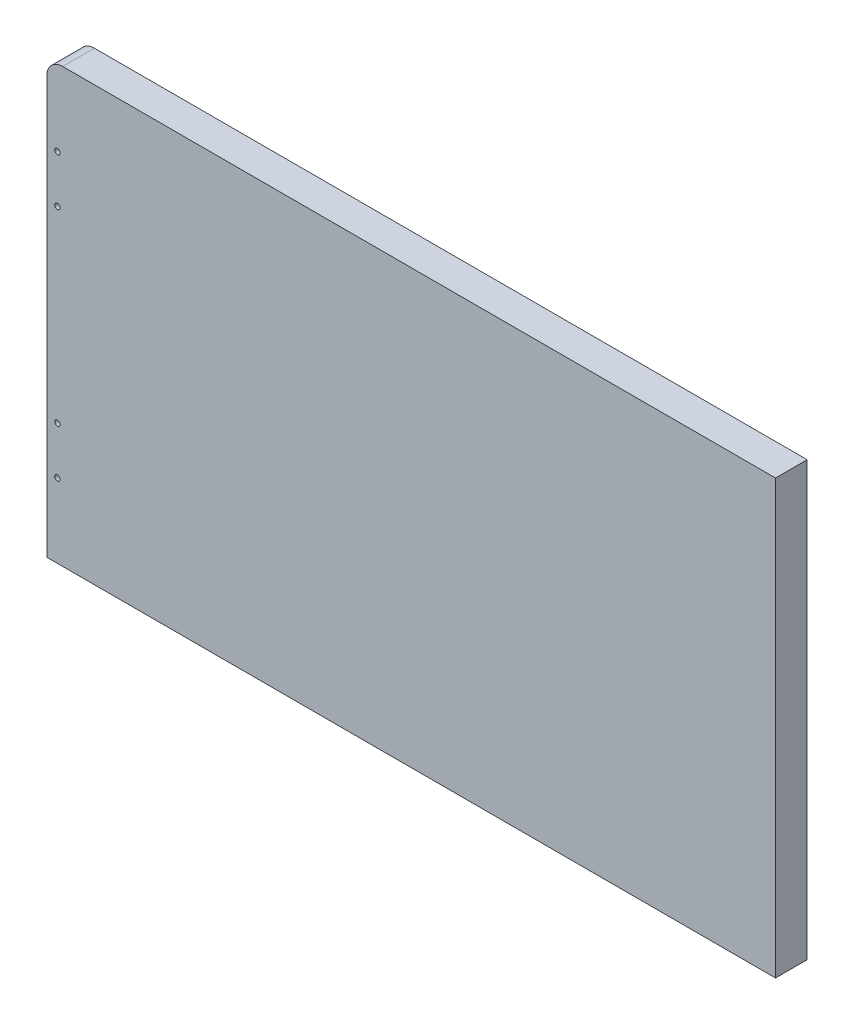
from build123d import *

# Parameters (mm, degrees)
SKETCH1_W           = 1380
SKETCH1_H           = 820
BOSS_EXTRUDE1_DEPTH = 60
FILLET2_R           = 30
SKETCH2_R           = 5
CUT_EXTRUDE1_DEPTH  = 10


with BuildPart() as part:
    # Sketch1 → Boss-Extrude1 (new body)
    with BuildSketch(Plane.XY):
        Rectangle(SKETCH1_W, SKETCH1_H)
    extrude(amount=BOSS_EXTRUDE1_DEPTH)

    # Fillet2
    fillet2_edges = [part.edges().sort_by_distance(p)[0] for p in [
        (-690, 410, 30),
    ]]
    fillet(fillet2_edges, radius=FILLET2_R)

    # Sketch2 → Cut-Extrude1 (cut)
    with BuildSketch(Plane.XY.offset(60)):
        with Locations((-670, 265.440772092)):
            Circle(SKETCH2_R)
        with Locations((-670, 175.317645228)):
            Circle(SKETCH2_R)
        with Locations((-670, -270)):
            Circle(SKETCH2_R)
        with Locations((-669.930940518, -180.000026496)):
            Circle(SKETCH2_R)
    extrude(amount=-CUT_EXTRUDE1_DEPTH, mode=Mode.SUBTRACT)


solid = part.part
